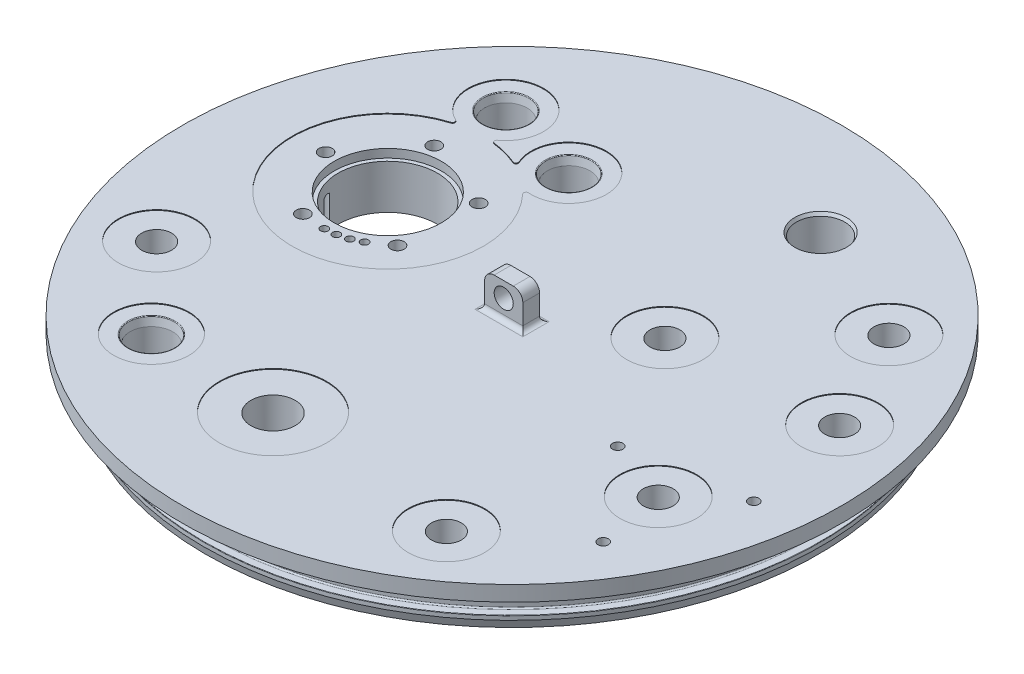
from build123d import *

# Parameters (mm, degrees)
SKETCH242_R                        = 3.175
BOSS_EXTRUDE1_DEPTH                = 2.778125
CTD_PORT_D                         = 33.02
CTD_PORT_CBORE_D                   = 35.56
CTD_PORT_CBORE_DEPTH               = 3.048
SKETCH237_R                        = 31.75
CUT_EXTRUDE1_DEPTH                 = 0.254
F_38_0_1015_DIAMETER_HOLE1_D       = 2.54
F_17_0_173_DIAMETER_HOLE1_D        = 4.3942
THREAD_FOR_ANTENNA_PORT_D          = 14.68374
ANTENNA_PORT_D                     = 6.7564
ANTENNA_PORT_CBORE_D               = 35.56
ANTENNA_PORT_CBORE_DEPTH           = 0.254
SUBCONN_SWAGELOK_PORTS_D           = 2.54
SUBCONN_SWAGELOK_PORTS_DEPTH       = 25.4
SUBCONN_SWAGELOK_PORTS_CBORE_D     = 25.4
SUBCONN_SWAGELOK_PORTS_CBORE_DEPTH = 0.254
F_7_16_20_TAPPED_HOLE1_D           = 9.92124
FILLET1_R                          = 0.762
FILLET2_R                          = 1.5875
F_8_32_TAPPED_HOLE1_D              = 3.4544
F_8_32_TAPPED_HOLE1_DEPTH          = 10.668
F_8_32_TAPPED_HOLE1_TIP            = 1.037806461
F_8_32_TAPPED_HOLE3_D              = 3.4544
F_8_32_TAPPED_HOLE3_DEPTH          = 10.668
F_8_32_TAPPED_HOLE3_TIP            = 1.037806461
CIRPATTERN1_COUNT                  = 12


with BuildPart() as part:
    # Sketch1 → Revolve1 (revolve)
    with BuildSketch(Plane.XY, mode=Mode.PRIVATE) as revolve1_sk:
        Polygon((0, 5.08), (-109.5375, 5.08), (-109.5375, 0), (-102.5779, 0), (-102.5779, -10.16), (-101.897309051, -12.7), (0, -12.7), align=None)
    revolve(revolve1_sk.sketch.rotate(Axis((0, -18.420388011, 0), (0, 1, 0)), 270), axis=Axis((0, -18.420388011, 0), (0, 1, 0)))

    # Sketch242 → Boss-Extrude1 (add, symmetric)
    with BuildSketch(Plane.XY):
        with BuildLine():
            Line((-3.175, 16.51), (3.175, 16.51))
            ThreePointArc((3.175, 16.51), (5.42006403, 15.58006403), (6.35, 13.335))
            Line((6.35, 13.335), (6.35, 5.08))
            Line((6.35, 5.08), (-6.35, 5.08))
            Line((-6.35, 5.08), (-6.35, 13.335))
            ThreePointArc((-6.35, 13.335), (-5.42006403, 15.58006403), (-3.175, 16.51))
        make_face()
        with Locations((0, 11.43)):
            Circle(SKETCH242_R, mode=Mode.SUBTRACT)
    extrude(amount=BOSS_EXTRUDE1_DEPTH, both=True)

    # Sketch234 → 2-265 O-Ring (revolve, cut)
    with BuildSketch(Plane.XY, mode=Mode.PRIVATE) as f_2_265_o_ring_sk:
        with BuildLine():
            Line((-102.4509, -3.94335), (-100.1776, -3.94335))
            ThreePointArc((-100.1776, -3.94335), (-99.863291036, -4.073541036), (-99.7331, -4.38785))
            Line((-99.7331, -4.38785), (-99.7331, -8.31215))
            ThreePointArc((-99.7331, -8.31215), (-99.863291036, -8.626458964), (-100.1776, -8.75665))
            Line((-100.1776, -8.75665), (-102.4509, -8.75665))
            ThreePointArc((-102.4509, -8.75665), (-102.540702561, -8.793847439), (-102.5779, -8.88365))
            Line((-102.5779, -8.88365), (-102.5779, -3.81635))
            ThreePointArc((-102.5779, -3.81635), (-102.540702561, -3.906152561), (-102.4509, -3.94335))
        make_face()
    revolve(f_2_265_o_ring_sk.sketch.rotate(Axis((0, 0, 0), (0, -1, 0)), 270), axis=Axis((0, 0, 0), (0, -1, 0)), mode=Mode.SUBTRACT)

    # CTD Port (through all)
    with Locations(Plane(origin=(0, 5.08, 0), x_dir=(1, 0, 0), z_dir=(0, 1, 0))):
        with Locations((-56.429386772, 15.120208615)):
            CounterBoreHole(CTD_PORT_D / 2, CTD_PORT_CBORE_D / 2, CTD_PORT_CBORE_DEPTH)

    # Sketch237 → Cut-Extrude1 (cut)
    with BuildSketch(Plane(origin=(0, 5.08, 0), x_dir=(1, 0, 0), z_dir=(0, 1, 0))):
        with Locations(Location((-56.429386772, 15.120208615, 0), (0, 0, 270))):
            Circle(SKETCH237_R)
    extrude(amount=-CUT_EXTRUDE1_DEPTH, mode=Mode.SUBTRACT)

    # 38 _0.1015_ Diameter Hole1 (through all)
    with Locations(Plane(origin=(0, 5.08, 0), x_dir=(1, 0, 0), z_dir=(0, 1, 0))):
        with Locations((-56.429386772, -5.961791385), (-52.76853589, -5.641508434), (-49.21891811, -4.690391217), (-45.888386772, -3.137338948)):
            Hole(F_38_0_1015_DIAMETER_HOLE1_D / 2)

    # 17 _0.173_ Diameter Hole1 (through all)
    with Locations(Plane(origin=(0, 5.08, 0), x_dir=(1, 0, 0), z_dir=(0, 1, 0))):
        with Locations((-62.083029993, 36.219892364), (-78.243450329, 16.263435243), (-64.257576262, -5.272922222), (-39.45341039, 1.373333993), (-38.109466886, 27.017303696)):
            Hole(F_17_0_173_DIAMETER_HOLE1_D / 2)

    # Port Sketch1 → SAE Port1 (revolve, cut)
    with BuildSketch(Plane(origin=(-57.135452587, 5.08, -58.135895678), x_dir=(-1, 0, 0), z_dir=(0, 0, 1)), mode=Mode.PRIVATE) as sae_port1_sk:
        with BuildLine():
            Line((3.057319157, 54.988507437), (9.605439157, 51.054))
            Line((9.605439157, 51.054), (9.605439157, 12.954))
            Line((9.605439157, 12.954), (10.201069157, 12.954))
            Line((10.201069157, 12.954), (10.201069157, 2.880662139))
            Line((10.201069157, 2.880662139), (10.127731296, 2.954))
            Line((10.127731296, 2.954), (10.658869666, 0.455190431))
            ThreePointArc((10.658869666, 0.455190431), (10.747471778, 0.310604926), (10.907319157, 0.254))
            Line((10.907319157, 0.254), (15.557319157, 0.254))
            Line((15.557319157, 0.254), (15.557319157, 0))
            Line((15.557319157, 0), (3.057319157, 0))
            Line((3.057319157, 0), (3.057319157, 54.988507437))
        make_face()
    revolve(sae_port1_sk.sketch.rotate(Axis((-60.192771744, 5.08, -58.135895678), (0, -1, 0)), 270), axis=Axis((-60.192771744, 5.08, -58.135895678), (0, -1, 0)), mode=Mode.SUBTRACT)

    # Port Sketch2 → SAE Port2 (revolve, cut)
    with BuildSketch(Plane(origin=(-29.371101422, 5.08, -52.515385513), x_dir=(-0.749432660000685, 0, 0.6620805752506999), z_dir=(0.6620805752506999, 0, 0.749432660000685)), mode=Mode.PRIVATE) as sae_port2_sk:
        with BuildLine():
            Line((3.057319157, 29.588507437), (9.605439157, 25.654))
            Line((9.605439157, 25.654), (9.605439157, 12.954))
            Line((9.605439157, 12.954), (10.201069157, 12.954))
            Line((10.201069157, 12.954), (10.201069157, 2.880662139))
            Line((10.201069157, 2.880662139), (10.127731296, 2.954))
            Line((10.127731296, 2.954), (10.658869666, 0.455190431))
            ThreePointArc((10.658869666, 0.455190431), (10.747471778, 0.310604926), (10.907319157, 0.254))
            Line((10.907319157, 0.254), (15.557319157, 0.254))
            Line((15.557319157, 0.254), (15.557319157, 0))
            Line((15.557319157, 0), (3.057319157, 0))
            Line((3.057319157, 0), (3.057319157, 29.588507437))
        make_face()
    revolve(sae_port2_sk.sketch.rotate(Axis((-31.66235625, 5.08, -50.491193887), (0, -1, 0)), 311.458742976), axis=Axis((-31.66235625, 5.08, -50.491193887), (0, -1, 0)), mode=Mode.SUBTRACT)

    # Port Sketch → SAE Port (revolve, cut)
    with BuildSketch(Plane(origin=(-53.602314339, 5.08, 65.77339864), x_dir=(-0.8796575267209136, 0, -0.47560764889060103), z_dir=(-0.47560764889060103, 0, 0.8796575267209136)), mode=Mode.PRIVATE) as sae_port_sk:
        with BuildLine():
            Line((1.241941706, 29.588507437), (7.790061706, 25.654))
            Line((7.790061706, 25.654), (7.790061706, 12.954))
            Line((7.790061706, 12.954), (8.385691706, 12.954))
            Line((8.385691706, 12.954), (8.385691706, 2.880662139))
            Line((8.385691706, 2.880662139), (8.312353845, 2.954))
            Line((8.312353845, 2.954), (8.843492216, 0.455190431))
            ThreePointArc((8.843492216, 0.455190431), (8.932094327, 0.310604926), (9.091941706, 0.254))
            Line((9.091941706, 0.254), (13.741941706, 0.254))
            Line((13.741941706, 0.254), (13.741941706, 0))
            Line((13.741941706, 0), (1.241941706, 0))
            Line((1.241941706, 0), (1.241941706, 29.588507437))
        make_face()
    revolve(sae_port_sk.sketch.rotate(Axis((-54.694797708, 5.08, 65.182721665), (0, -1, 0)), 241.601078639), axis=Axis((-54.694797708, 5.08, 65.182721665), (0, -1, 0)), mode=Mode.SUBTRACT)

    # Sketch41 → Optode Port (revolve, cut)
    with BuildSketch(Plane(origin=(27.365031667, -12.7, -75.184806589), x_dir=(0, 0, -1), z_dir=(1, 0, 0))):
        Polygon((0, 0), (0, 17.78), (8.606588, 17.78), (8.02, 16.763999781), (8.02, 0), align=None)
    revolve(axis=Axis((27.365031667, -19.05, -75.184806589), (0, 1, 0)), mode=Mode.SUBTRACT)

    # Thread For Antenna Port (through all)
    with Locations(Plane(origin=(0, 5.08, 0), x_dir=(1, 0, 0), z_dir=(0, 1, 0))):
        with Locations((-11.908792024, -67.538115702)):
            Hole(THREAD_FOR_ANTENNA_PORT_D / 2)

    # Antenna Port (through all)
    with Locations(Plane(origin=(0, 5.08, 0), x_dir=(1, 0, 0), z_dir=(0, 1, 0))):
        with Locations((-11.908792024, -67.538115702)):
            CounterBoreHole(ANTENNA_PORT_D / 2, ANTENNA_PORT_CBORE_D / 2, ANTENNA_PORT_CBORE_DEPTH)

    # Subconn _ Swagelok Ports
    with Locations(Plane(origin=(0, 5.08, 0), x_dir=(1, 0, 0), z_dir=(0, 1, 0))):
        with Locations((85.870805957, 23.00901311), (50.990945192, -72.822616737), (68.101350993, 57.143818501), (76.378216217, -27.79939725), (31.75, 19.05), (-80.570762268, -37.570763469)):
            CounterBoreHole(SUBCONN_SWAGELOK_PORTS_D / 2, SUBCONN_SWAGELOK_PORTS_CBORE_D / 2, SUBCONN_SWAGELOK_PORTS_CBORE_DEPTH, depth=SUBCONN_SWAGELOK_PORTS_DEPTH)

    # 7_16-20 Tapped Hole1 (through all)
    with Locations(Plane(origin=(0, 5.08, 0), x_dir=(1, 0, 0), z_dir=(0, 1, 0))):
        with Locations((50.990945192, -72.822616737), (68.101350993, 57.143818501), (76.378216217, -27.79939725), (85.870805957, 23.00901311), (31.75, 19.05), (-80.570762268, -37.570763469)):
            Hole(F_7_16_20_TAPPED_HOLE1_D / 2)

    # Fillet1
    fillet1_edges = [part.edges().sort_by_distance(p)[0] for p in [
        (-54.858313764, 4.953, -46.831314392),
        (-63.48316738, 4.953, -46.076737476),
        (-34.842369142, 4.953, -38.402458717),
        (-41.934423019, 4.953, -43.368368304),
    ]]
    fillet(fillet1_edges, radius=FILLET1_R)

    # Fillet2
    fillet2_edges = [part.edges().sort_by_distance(p)[0] for p in [
        (0, 5.08, 2.778125),
        (0, 5.08, -2.778125),
        (-6.35, 5.08, 0),
        (6.35, 5.08, 0),
    ]]
    fillet(fillet2_edges, radius=FILLET2_R)

    # 8-32 Tapped Hole1
    with Locations(Plane(origin=(0, -12.7, 0), x_dir=(-1, 0, 0), z_dir=(0, -1, 0))):
        with Locations((-62.8058219, 32.369860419), (-60.062761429, 43.465829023), (-71.158730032, 46.208889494), (70.654022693, -0.623061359), (73.397083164, 10.472907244), (84.493051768, 7.729846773)):
            Hole(F_8_32_TAPPED_HOLE1_D / 2, depth=F_8_32_TAPPED_HOLE1_DEPTH)
            with Locations((0, 0, -(F_8_32_TAPPED_HOLE1_DEPTH + F_8_32_TAPPED_HOLE1_TIP / 2))):  # 118° drill point
                Cone(0, F_8_32_TAPPED_HOLE1_D / 2, F_8_32_TAPPED_HOLE1_TIP, mode=Mode.SUBTRACT)

    # Sketch247 → 8-32 Tapped Hole2 (revolve, cut)
    with BuildSketch(Plane(origin=(75.910035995, -12.7, 6.641267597), x_dir=(0, 0, -1), z_dir=(1, 0, 0))):
        Polygon((0, 0), (0, 11.705806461), (1.7272, 10.668), (1.7272, 0), align=None)
    f_8_32_tapped_hole2 = revolve(axis=Axis((75.910035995, -19.05, 6.641267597), (0, 1, 0)), mode=Mode.SUBTRACT)

    # 8-32 Tapped Hole3
    with Locations(Plane(origin=(0, 5.08, 0), x_dir=(1, 0, 0), z_dir=(0, 1, 0))):
        with Locations((80.292680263, -49.999426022), (93.646773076, -13.309357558), (55.195195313, -20.089408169)):
            Hole(F_8_32_TAPPED_HOLE3_D / 2, depth=F_8_32_TAPPED_HOLE3_DEPTH)
            with Locations((0, 0, -(F_8_32_TAPPED_HOLE3_DEPTH + F_8_32_TAPPED_HOLE3_TIP / 2))):  # 118° drill point
                Cone(0, F_8_32_TAPPED_HOLE3_D / 2, F_8_32_TAPPED_HOLE3_TIP, mode=Mode.SUBTRACT)

    # CirPattern1: 8-32 Tapped Hole2 ×12 about axis, 5 skipped
    cirpattern1_axis = Axis((0, 0, 0), (0, -1, 0))
    add([f_8_32_tapped_hole2.rotate(cirpattern1_axis, i * 360 / CIRPATTERN1_COUNT) for i in range(1, CIRPATTERN1_COUNT) if i not in (3, 4, 6, 7, 9)], mode=Mode.SUBTRACT)


solid = part.part
